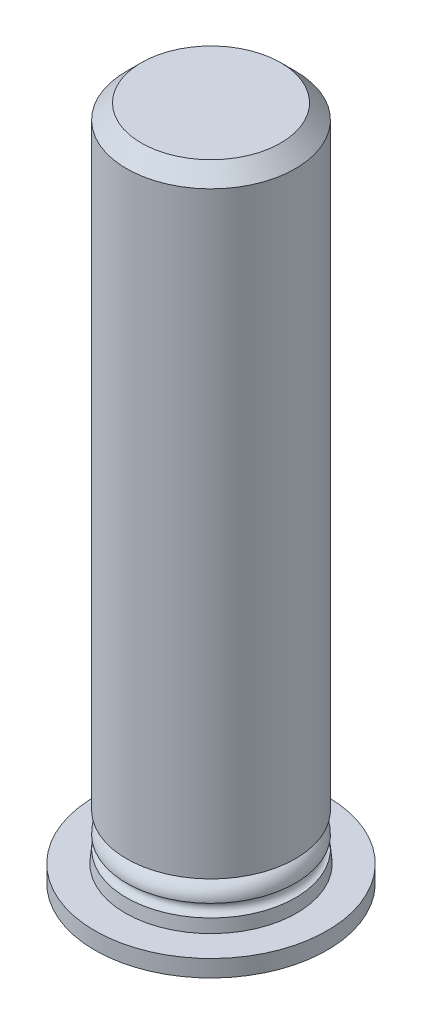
ISO-10303-21;
HEADER;
FILE_DESCRIPTION(('STEP AP214'),'2;1');
FILE_NAME('part.step','',(''),(''),'','','');
FILE_SCHEMA(('AUTOMOTIVE_DESIGN { 1 0 10303 214 1 1 1 1 }'));
ENDSEC;
DATA;
#1=APPLICATION_CONTEXT('core data for automotive mechanical design processes');
#2=APPLICATION_PROTOCOL_DEFINITION('international standard','automotive_design',2000,#1);
#3=PRODUCT_CONTEXT('',#1,'mechanical');
#4=PRODUCT('Part','Part','',(#3));
#5=PRODUCT_RELATED_PRODUCT_CATEGORY('part','',(#4));
#6=PRODUCT_DEFINITION_FORMATION('','',#4);
#7=PRODUCT_DEFINITION_CONTEXT('part definition',#1,'design');
#8=PRODUCT_DEFINITION('design','',#6,#7);
#9=PRODUCT_DEFINITION_SHAPE('','',#8);
#10=(LENGTH_UNIT() NAMED_UNIT(*) SI_UNIT(.MILLI.,.METRE.));
#11=(NAMED_UNIT(*) PLANE_ANGLE_UNIT() SI_UNIT($,.RADIAN.));
#12=(NAMED_UNIT(*) SI_UNIT($,.STERADIAN.) SOLID_ANGLE_UNIT());
#13=UNCERTAINTY_MEASURE_WITH_UNIT(LENGTH_MEASURE(1.E-05),#10,'distance_accuracy_value','');
#14=(GEOMETRIC_REPRESENTATION_CONTEXT(3) GLOBAL_UNCERTAINTY_ASSIGNED_CONTEXT((#13)) GLOBAL_UNIT_ASSIGNED_CONTEXT((#10,
#11,#12)) REPRESENTATION_CONTEXT('',''));
#15=CARTESIAN_POINT('',(0.,0.,0.));
#16=DIRECTION('',(0.,0.,1.));
#17=DIRECTION('',(1.,0.,0.));
#18=AXIS2_PLACEMENT_3D('',#15,#16,#17);
#19=CARTESIAN_POINT('',(0.,0.,0.));
#20=DIRECTION('',(0.,-1.,0.));
#21=DIRECTION('',(0.,0.,-1.));
#22=AXIS2_PLACEMENT_3D('',#19,#20,#21);
#23=PLANE('',#22);
#24=CARTESIAN_POINT('',(0.,0.,0.));
#25=DIRECTION('',(0.,-1.,0.));
#26=DIRECTION('',(0.,0.,-1.));
#27=AXIS2_PLACEMENT_3D('',#24,#25,#26);
#28=CIRCLE('',#27,2.75);
#29=CARTESIAN_POINT('',(0.,0.,-2.75));
#30=VERTEX_POINT('',#29);
#31=EDGE_CURVE('E10',#30,#30,#28,.T.);
#32=ORIENTED_EDGE('',*,*,#31,.T.);
#33=EDGE_LOOP('',(#32));
#34=FACE_BOUND('',#33,.T.);
#35=ADVANCED_FACE('F30',(#34),#23,.T.);
#36=CARTESIAN_POINT('',(0.,0.,0.));
#37=DIRECTION('',(0.,-1.,0.));
#38=DIRECTION('',(0.,0.,-1.));
#39=AXIS2_PLACEMENT_3D('',#36,#37,#38);
#40=CYLINDRICAL_SURFACE('',#39,2.75);
#41=CARTESIAN_POINT('',(0.,0.4,0.));
#42=DIRECTION('',(0.,-1.,0.));
#43=DIRECTION('',(0.,0.,-1.));
#44=AXIS2_PLACEMENT_3D('',#41,#42,#43);
#45=CIRCLE('',#44,2.75);
#46=CARTESIAN_POINT('',(0.,0.4,-2.75));
#47=VERTEX_POINT('',#46);
#48=EDGE_CURVE('E36',#47,#47,#45,.T.);
#49=ORIENTED_EDGE('',*,*,#48,.T.);
#50=EDGE_LOOP('',(#49));
#51=FACE_BOUND('',#50,.T.);
#52=ORIENTED_EDGE('',*,*,#31,.F.);
#53=EDGE_LOOP('',(#52));
#54=FACE_BOUND('',#53,.T.);
#55=ADVANCED_FACE('F80',(#51,#54),#40,.T.);
#56=CARTESIAN_POINT('',(2.75,0.4,0.));
#57=DIRECTION('',(0.,1.,0.));
#58=DIRECTION('',(0.,0.,1.));
#59=AXIS2_PLACEMENT_3D('',#56,#57,#58);
#60=PLANE('',#59);
#61=CARTESIAN_POINT('',(0.,0.4,0.));
#62=DIRECTION('',(0.,-1.,0.));
#63=DIRECTION('',(0.,0.,-1.));
#64=AXIS2_PLACEMENT_3D('',#61,#62,#63);
#65=CIRCLE('',#64,2.02888671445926);
#66=CARTESIAN_POINT('',(0.,0.4,-2.02888671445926));
#67=VERTEX_POINT('',#66);
#68=EDGE_CURVE('E40',#67,#67,#65,.T.);
#69=ORIENTED_EDGE('',*,*,#68,.T.);
#70=EDGE_LOOP('',(#69));
#71=FACE_BOUND('',#70,.T.);
#72=ORIENTED_EDGE('',*,*,#48,.F.);
#73=EDGE_LOOP('',(#72));
#74=FACE_BOUND('',#73,.T.);
#75=ADVANCED_FACE('F84',(#71,#74),#60,.T.);
#76=CARTESIAN_POINT('',(0.,0.4,0.));
#77=DIRECTION('',(0.,-1.,0.));
#78=DIRECTION('',(0.,0.,-1.));
#79=AXIS2_PLACEMENT_3D('',#76,#77,#78);
#80=CONICAL_SURFACE('',#79,2.02888671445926,0.0959931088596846);
#81=CARTESIAN_POINT('',(0.,0.7,0.));
#82=DIRECTION('',(0.,-1.,0.));
#83=DIRECTION('',(0.,0.,-1.));
#84=AXIS2_PLACEMENT_3D('',#81,#82,#83);
#85=CIRCLE('',#84,2.);
#86=CARTESIAN_POINT('',(0.,0.7,-2.));
#87=VERTEX_POINT('',#86);
#88=EDGE_CURVE('E44',#87,#87,#85,.T.);
#89=ORIENTED_EDGE('',*,*,#88,.T.);
#90=EDGE_LOOP('',(#89));
#91=FACE_BOUND('',#90,.T.);
#92=ORIENTED_EDGE('',*,*,#68,.F.);
#93=EDGE_LOOP('',(#92));
#94=FACE_BOUND('',#93,.T.);
#95=ADVANCED_FACE('F88',(#91,#94),#80,.T.);
#96=CARTESIAN_POINT('',(0.,0.85,0.));
#97=DIRECTION('',(0.,-1.,0.));
#98=DIRECTION('',(0.,0.,-1.));
#99=AXIS2_PLACEMENT_3D('',#96,#97,#98);
#100=TOROIDAL_SURFACE('',#99,2.,0.15);
#101=CARTESIAN_POINT('',(0.,1.,0.));
#102=DIRECTION('',(0.,-1.,0.));
#103=DIRECTION('',(0.,0.,-1.));
#104=AXIS2_PLACEMENT_3D('',#101,#102,#103);
#105=CIRCLE('',#104,2.);
#106=CARTESIAN_POINT('',(0.,1.,-2.));
#107=VERTEX_POINT('',#106);
#108=EDGE_CURVE('E49',#107,#107,#105,.T.);
#109=ORIENTED_EDGE('',*,*,#108,.T.);
#110=EDGE_LOOP('',(#109));
#111=FACE_BOUND('',#110,.T.);
#112=ORIENTED_EDGE('',*,*,#88,.F.);
#113=EDGE_LOOP('',(#112));
#114=FACE_BOUND('',#113,.T.);
#115=ADVANCED_FACE('F95',(#111,#114),#100,.F.);
#116=CARTESIAN_POINT('',(0.,1.,0.));
#117=DIRECTION('',(0.,-1.,0.));
#118=DIRECTION('',(0.,0.,-1.));
#119=AXIS2_PLACEMENT_3D('',#116,#117,#118);
#120=TOROIDAL_SURFACE('',#119,1.65,0.350000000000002);
#121=CARTESIAN_POINT('',(0.,1.35,0.));
#122=DIRECTION('',(0.,-1.,0.));
#123=DIRECTION('',(0.,0.,-1.));
#124=AXIS2_PLACEMENT_3D('',#121,#122,#123);
#125=CIRCLE('',#124,1.65);
#126=CARTESIAN_POINT('',(0.,1.35,-1.65));
#127=VERTEX_POINT('',#126);
#128=EDGE_CURVE('E52',#127,#127,#125,.T.);
#129=ORIENTED_EDGE('',*,*,#128,.T.);
#130=EDGE_LOOP('',(#129));
#131=FACE_BOUND('',#130,.T.);
#132=ORIENTED_EDGE('',*,*,#108,.F.);
#133=EDGE_LOOP('',(#132));
#134=FACE_BOUND('',#133,.T.);
#135=ADVANCED_FACE('F99',(#131,#134),#120,.T.);
#136=CARTESIAN_POINT('',(0.,0.,0.));
#137=DIRECTION('',(0.,-1.,0.));
#138=DIRECTION('',(0.,0.,-1.));
#139=AXIS2_PLACEMENT_3D('',#136,#137,#138);
#140=CYLINDRICAL_SURFACE('',#139,1.65);
#141=CARTESIAN_POINT('',(0.,1.5,0.));
#142=DIRECTION('',(0.,-1.,0.));
#143=DIRECTION('',(0.,0.,-1.));
#144=AXIS2_PLACEMENT_3D('',#141,#142,#143);
#145=CIRCLE('',#144,1.65);
#146=CARTESIAN_POINT('',(0.,1.5,-1.65));
#147=VERTEX_POINT('',#146);
#148=EDGE_CURVE('E55',#147,#147,#145,.T.);
#149=ORIENTED_EDGE('',*,*,#148,.T.);
#150=EDGE_LOOP('',(#149));
#151=FACE_BOUND('',#150,.T.);
#152=ORIENTED_EDGE('',*,*,#128,.F.);
#153=EDGE_LOOP('',(#152));
#154=FACE_BOUND('',#153,.T.);
#155=ADVANCED_FACE('F103',(#151,#154),#140,.T.);
#156=CARTESIAN_POINT('',(2.,1.5,0.));
#157=DIRECTION('',(0.,-1.,0.));
#158=DIRECTION('',(0.,0.,-1.));
#159=AXIS2_PLACEMENT_3D('',#156,#157,#158);
#160=PLANE('',#159);
#161=CARTESIAN_POINT('',(0.,1.5,0.));
#162=DIRECTION('',(0.,-1.,0.));
#163=DIRECTION('',(0.,0.,-1.));
#164=AXIS2_PLACEMENT_3D('',#161,#162,#163);
#165=CIRCLE('',#164,2.);
#166=CARTESIAN_POINT('',(0.,1.5,-2.));
#167=VERTEX_POINT('',#166);
#168=EDGE_CURVE('E58',#167,#167,#165,.T.);
#169=ORIENTED_EDGE('',*,*,#168,.T.);
#170=EDGE_LOOP('',(#169));
#171=FACE_BOUND('',#170,.T.);
#172=ORIENTED_EDGE('',*,*,#148,.F.);
#173=EDGE_LOOP('',(#172));
#174=FACE_BOUND('',#173,.T.);
#175=ADVANCED_FACE('F107',(#171,#174),#160,.T.);
#176=CARTESIAN_POINT('',(0.,0.,0.));
#177=DIRECTION('',(0.,-1.,0.));
#178=DIRECTION('',(0.,0.,-1.));
#179=AXIS2_PLACEMENT_3D('',#176,#177,#178);
#180=CYLINDRICAL_SURFACE('',#179,2.);
#181=CARTESIAN_POINT('',(0.,15.65,0.));
#182=DIRECTION('',(0.,-1.,0.));
#183=DIRECTION('',(0.,0.,-1.));
#184=AXIS2_PLACEMENT_3D('',#181,#182,#183);
#185=CIRCLE('',#184,2.);
#186=CARTESIAN_POINT('',(0.,15.65,-2.));
#187=VERTEX_POINT('',#186);
#188=EDGE_CURVE('E61',#187,#187,#185,.T.);
#189=ORIENTED_EDGE('',*,*,#188,.T.);
#190=EDGE_LOOP('',(#189));
#191=FACE_BOUND('',#190,.T.);
#192=ORIENTED_EDGE('',*,*,#168,.F.);
#193=EDGE_LOOP('',(#192));
#194=FACE_BOUND('',#193,.T.);
#195=ADVANCED_FACE('F77',(#191,#194),#180,.T.);
#196=CARTESIAN_POINT('',(0.,15.65,0.));
#197=DIRECTION('',(0.,-1.,0.));
#198=DIRECTION('',(0.,0.,-1.));
#199=AXIS2_PLACEMENT_3D('',#196,#197,#198);
#200=CONICAL_SURFACE('',#199,2.,0.785398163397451);
#201=CARTESIAN_POINT('',(0.,16.,0.));
#202=DIRECTION('',(0.,-1.,0.));
#203=DIRECTION('',(0.,0.,-1.));
#204=AXIS2_PLACEMENT_3D('',#201,#202,#203);
#205=CIRCLE('',#204,1.65);
#206=CARTESIAN_POINT('',(0.,16.,-1.65));
#207=VERTEX_POINT('',#206);
#208=EDGE_CURVE('E64',#207,#207,#205,.T.);
#209=ORIENTED_EDGE('',*,*,#208,.T.);
#210=EDGE_LOOP('',(#209));
#211=FACE_BOUND('',#210,.T.);
#212=ORIENTED_EDGE('',*,*,#188,.F.);
#213=EDGE_LOOP('',(#212));
#214=FACE_BOUND('',#213,.T.);
#215=ADVANCED_FACE('F68',(#211,#214),#200,.T.);
#216=CARTESIAN_POINT('',(0.,16.,0.));
#217=DIRECTION('',(0.,1.,0.));
#218=DIRECTION('',(0.,0.,1.));
#219=AXIS2_PLACEMENT_3D('',#216,#217,#218);
#220=PLANE('',#219);
#221=ORIENTED_EDGE('',*,*,#208,.F.);
#222=EDGE_LOOP('',(#221));
#223=FACE_BOUND('',#222,.T.);
#224=ADVANCED_FACE('F71',(#223),#220,.T.);
#225=CLOSED_SHELL('',(#35,#55,#75,#95,#115,#135,#155,#175,#195,#215,#224));
#226=MANIFOLD_SOLID_BREP('B2',#225);
#227=ADVANCED_BREP_SHAPE_REPRESENTATION('',(#18,#226),#14);
#228=SHAPE_DEFINITION_REPRESENTATION(#9,#227);
ENDSEC;
END-ISO-10303-21;
